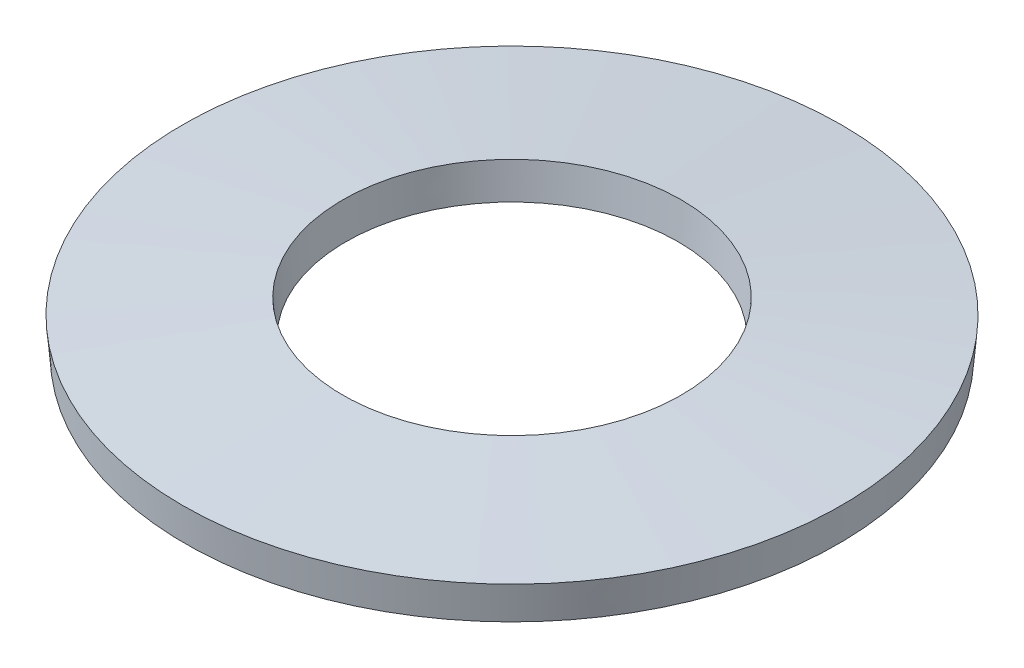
ISO-10303-21;
HEADER;
FILE_DESCRIPTION(('STEP AP214'),'2;1');
FILE_NAME('part.step','',(''),(''),'','','');
FILE_SCHEMA(('AUTOMOTIVE_DESIGN { 1 0 10303 214 1 1 1 1 }'));
ENDSEC;
DATA;
#1=APPLICATION_CONTEXT('core data for automotive mechanical design processes');
#2=APPLICATION_PROTOCOL_DEFINITION('international standard','automotive_design',2000,#1);
#3=PRODUCT_CONTEXT('',#1,'mechanical');
#4=PRODUCT('Part','Part','',(#3));
#5=PRODUCT_RELATED_PRODUCT_CATEGORY('part','',(#4));
#6=PRODUCT_DEFINITION_FORMATION('','',#4);
#7=PRODUCT_DEFINITION_CONTEXT('part definition',#1,'design');
#8=PRODUCT_DEFINITION('design','',#6,#7);
#9=PRODUCT_DEFINITION_SHAPE('','',#8);
#10=(LENGTH_UNIT() NAMED_UNIT(*) SI_UNIT(.MILLI.,.METRE.));
#11=(NAMED_UNIT(*) PLANE_ANGLE_UNIT() SI_UNIT($,.RADIAN.));
#12=(NAMED_UNIT(*) SI_UNIT($,.STERADIAN.) SOLID_ANGLE_UNIT());
#13=UNCERTAINTY_MEASURE_WITH_UNIT(LENGTH_MEASURE(1.E-05),#10,'distance_accuracy_value','');
#14=(GEOMETRIC_REPRESENTATION_CONTEXT(3) GLOBAL_UNCERTAINTY_ASSIGNED_CONTEXT((#13)) GLOBAL_UNIT_ASSIGNED_CONTEXT((#10,
#11,#12)) REPRESENTATION_CONTEXT('',''));
#15=CARTESIAN_POINT('',(0.,0.,0.));
#16=DIRECTION('',(0.,0.,1.));
#17=DIRECTION('',(1.,0.,0.));
#18=AXIS2_PLACEMENT_3D('',#15,#16,#17);
#19=CARTESIAN_POINT('',(0.,15.9427169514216,0.));
#20=DIRECTION('',(0.,1.,0.));
#21=DIRECTION('',(0.,0.,1.));
#22=AXIS2_PLACEMENT_3D('',#19,#20,#21);
#23=CONICAL_SURFACE('',#22,14.25,0.0872664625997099);
#24=CARTESIAN_POINT('',(0.,18.9313010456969,0.));
#25=DIRECTION('',(0.,-1.,0.));
#26=DIRECTION('',(0.,0.,-1.));
#27=AXIS2_PLACEMENT_3D('',#24,#25,#26);
#28=CIRCLE('',#27,14.511467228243);
#29=CARTESIAN_POINT('',(0.,18.9313010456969,-14.511467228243));
#30=VERTEX_POINT('',#29);
#31=EDGE_CURVE('E56',#30,#30,#28,.T.);
#32=ORIENTED_EDGE('',*,*,#31,.F.);
#33=EDGE_LOOP('',(#32));
#34=FACE_BOUND('',#33,.T.);
#35=CARTESIAN_POINT('',(0.,15.9427169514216,0.));
#36=DIRECTION('',(0.,-1.,0.));
#37=DIRECTION('',(0.,0.,-1.));
#38=AXIS2_PLACEMENT_3D('',#35,#36,#37);
#39=CIRCLE('',#38,14.25);
#40=CARTESIAN_POINT('',(0.,15.9427169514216,-14.25));
#41=VERTEX_POINT('',#40);
#42=EDGE_CURVE('E10',#41,#41,#39,.T.);
#43=ORIENTED_EDGE('',*,*,#42,.T.);
#44=EDGE_LOOP('',(#43));
#45=FACE_BOUND('',#44,.T.);
#46=ADVANCED_FACE('F39',(#34,#45),#23,.F.);
#47=CARTESIAN_POINT('',(0.,15.9427169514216,0.));
#48=DIRECTION('',(0.,-1.,0.));
#49=DIRECTION('',(0.,0.,-1.));
#50=AXIS2_PLACEMENT_3D('',#47,#48,#49);
#51=CONICAL_SURFACE('',#50,14.25,1.47570825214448);
#52=CARTESIAN_POINT('',(0.,14.6313010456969,0.));
#53=DIRECTION('',(0.,-1.,0.));
#54=DIRECTION('',(0.,0.,-1.));
#55=AXIS2_PLACEMENT_3D('',#52,#53,#54);
#56=CIRCLE('',#55,28.);
#57=CARTESIAN_POINT('',(0.,14.6313010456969,-28.));
#58=VERTEX_POINT('',#57);
#59=EDGE_CURVE('E46',#58,#58,#56,.T.);
#60=ORIENTED_EDGE('',*,*,#59,.T.);
#61=EDGE_LOOP('',(#60));
#62=FACE_BOUND('',#61,.T.);
#63=ORIENTED_EDGE('',*,*,#42,.F.);
#64=EDGE_LOOP('',(#63));
#65=FACE_BOUND('',#64,.T.);
#66=ADVANCED_FACE('F67',(#62,#65),#51,.F.);
#67=CARTESIAN_POINT('',(0.,14.6313010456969,0.));
#68=DIRECTION('',(0.,1.,0.));
#69=DIRECTION('',(0.,0.,1.));
#70=AXIS2_PLACEMENT_3D('',#67,#68,#69);
#71=CONICAL_SURFACE('',#70,28.,0.0872664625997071);
#72=CARTESIAN_POINT('',(0.,17.6198851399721,0.));
#73=DIRECTION('',(0.,-1.,0.));
#74=DIRECTION('',(0.,0.,-1.));
#75=AXIS2_PLACEMENT_3D('',#72,#73,#74);
#76=CIRCLE('',#75,28.2614672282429);
#77=CARTESIAN_POINT('',(0.,17.6198851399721,-28.2614672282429));
#78=VERTEX_POINT('',#77);
#79=EDGE_CURVE('E51',#78,#78,#76,.T.);
#80=ORIENTED_EDGE('',*,*,#79,.T.);
#81=EDGE_LOOP('',(#80));
#82=FACE_BOUND('',#81,.T.);
#83=ORIENTED_EDGE('',*,*,#59,.F.);
#84=EDGE_LOOP('',(#83));
#85=FACE_BOUND('',#84,.T.);
#86=ADVANCED_FACE('F71',(#82,#85),#71,.T.);
#87=CARTESIAN_POINT('',(0.,17.6198851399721,0.));
#88=DIRECTION('',(0.,-1.,0.));
#89=DIRECTION('',(0.,0.,-1.));
#90=AXIS2_PLACEMENT_3D('',#87,#88,#89);
#91=CONICAL_SURFACE('',#90,28.2614672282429,1.47570825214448);
#92=ORIENTED_EDGE('',*,*,#31,.T.);
#93=EDGE_LOOP('',(#92));
#94=FACE_BOUND('',#93,.T.);
#95=ORIENTED_EDGE('',*,*,#79,.F.);
#96=EDGE_LOOP('',(#95));
#97=FACE_BOUND('',#96,.T.);
#98=ADVANCED_FACE('F63',(#94,#97),#91,.T.);
#99=CLOSED_SHELL('',(#46,#66,#86,#98));
#100=MANIFOLD_SOLID_BREP('B2',#99);
#101=ADVANCED_BREP_SHAPE_REPRESENTATION('',(#18,#100),#14);
#102=SHAPE_DEFINITION_REPRESENTATION(#9,#101);
ENDSEC;
END-ISO-10303-21;
